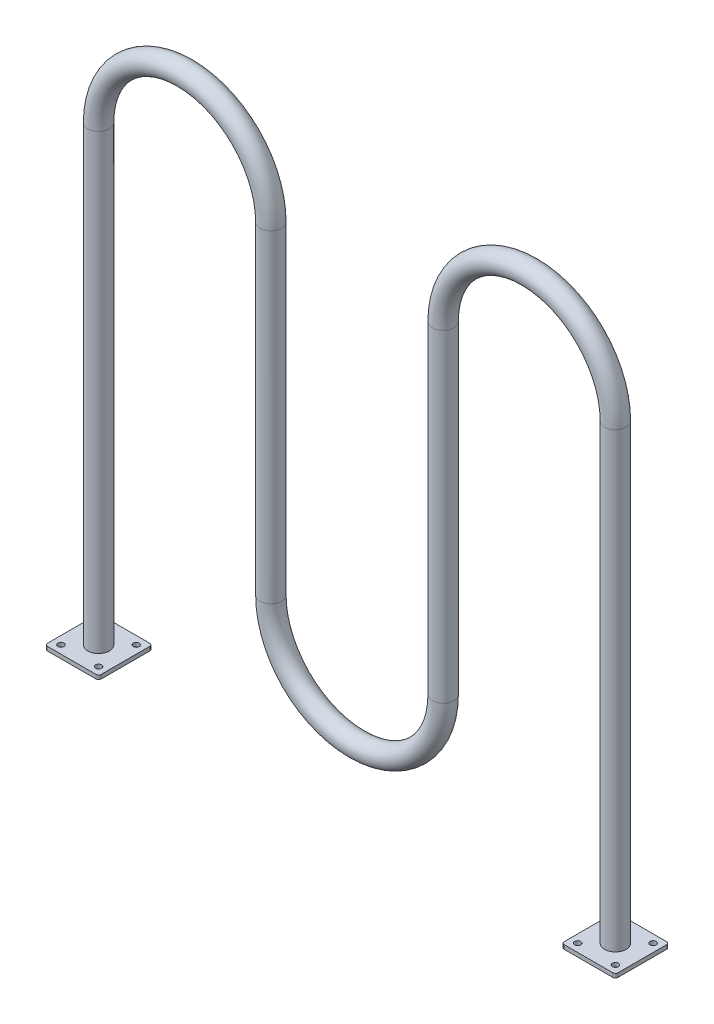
from build123d import *

# Parameters (mm, degrees)
SWEEP_THIN1_PROFILE_R   = 25.4
SWEEP_THIN1_PROFILE_R_2 = 22.225
SKETCH26_W              = 127
SKETCH26_H              = 127
SKETCH26_R              = 7.14375
BOSS_EXTRUDE1_DEPTH     = 9.525
FILLET1_R               = 6.35
FILLET1_OF_MIRROR1_R    = 6.35


with BuildPart() as part:
    # Sweep-Thin1: sweep along a path in Sketch1
    with BuildLine(Plane.XY) as sweep_thin1_path:
        Line((-609.6, -304.8), (-609.6, 762))
        ThreePointArc((-609.6, 762), (-406.4, 965.2), (-203.2, 762))
        Line((-203.2, 762), (-203.2, 0))
        ThreePointArc((-203.2, 0), (0, -203.2), (203.2, 0))
        Line((203.2, 0), (203.2, 762))
        ThreePointArc((203.2, 762), (406.4, 965.2), (609.6, 762))
        Line((609.6, 762), (609.6, -304.8))
    # Sweep-Thin1 profile (on start of the path) → Sweep-Thin1 (sweep)
    with BuildSketch(Plane(origin=(-609.6, -304.8, 0), x_dir=(1, 0, 0), z_dir=(0, 1, 0))):
        Circle(SWEEP_THIN1_PROFILE_R)
        Circle(SWEEP_THIN1_PROFILE_R_2, mode=Mode.SUBTRACT)
    sweep(path=sweep_thin1_path.line)

    # Sketch26 → Boss-Extrude1 (add)
    with BuildSketch(Plane.XZ.offset(304.8)):
        with Locations((-609.6, 0)):
            Rectangle(SKETCH26_W, SKETCH26_H)
        with Locations(Location((-654.05, 44.45, 0), (0, 0, 180))):
            Circle(SKETCH26_R, mode=Mode.SUBTRACT)
        with Locations(Location((-565.15, 44.45, 0), (0, 0, 180))):
            Circle(SKETCH26_R, mode=Mode.SUBTRACT)
        with Locations(Location((-565.15, -44.45, 0), (0, 0, 180))):
            Circle(SKETCH26_R, mode=Mode.SUBTRACT)
        with Locations(Location((-654.05, -44.45, 0), (0, 0, 180))):
            Circle(SKETCH26_R, mode=Mode.SUBTRACT)
    boss_extrude1 = extrude(amount=BOSS_EXTRUDE1_DEPTH)

    # Fillet1
    fillet1_edges = [part.edges().sort_by_distance(p)[0] for p in [
        (-546.1, -309.5625, -63.5),
        (-546.1, -309.5625, 63.5),
        (-673.1, -309.5625, 63.5),
        (-673.1, -309.5625, -63.5),
    ]]
    fillet(fillet1_edges, radius=FILLET1_R)

    # Mirror1: Boss-Extrude1 across plane
    add(boss_extrude1.mirror(Plane(origin=(0, 0, 0), x_dir=(0, 0, 1), z_dir=(1, 0, 0))))

    # Fillet1 of Mirror1
    fillet1_of_mirror1_edges = [part.edges().sort_by_distance(p)[0] for p in [
        (546.1, -309.5625, -63.5),
        (546.1, -309.5625, 63.5),
        (673.1, -309.5625, 63.5),
        (673.1, -309.5625, -63.5),
    ]]
    fillet(fillet1_of_mirror1_edges, radius=FILLET1_OF_MIRROR1_R)


solid = part.part
